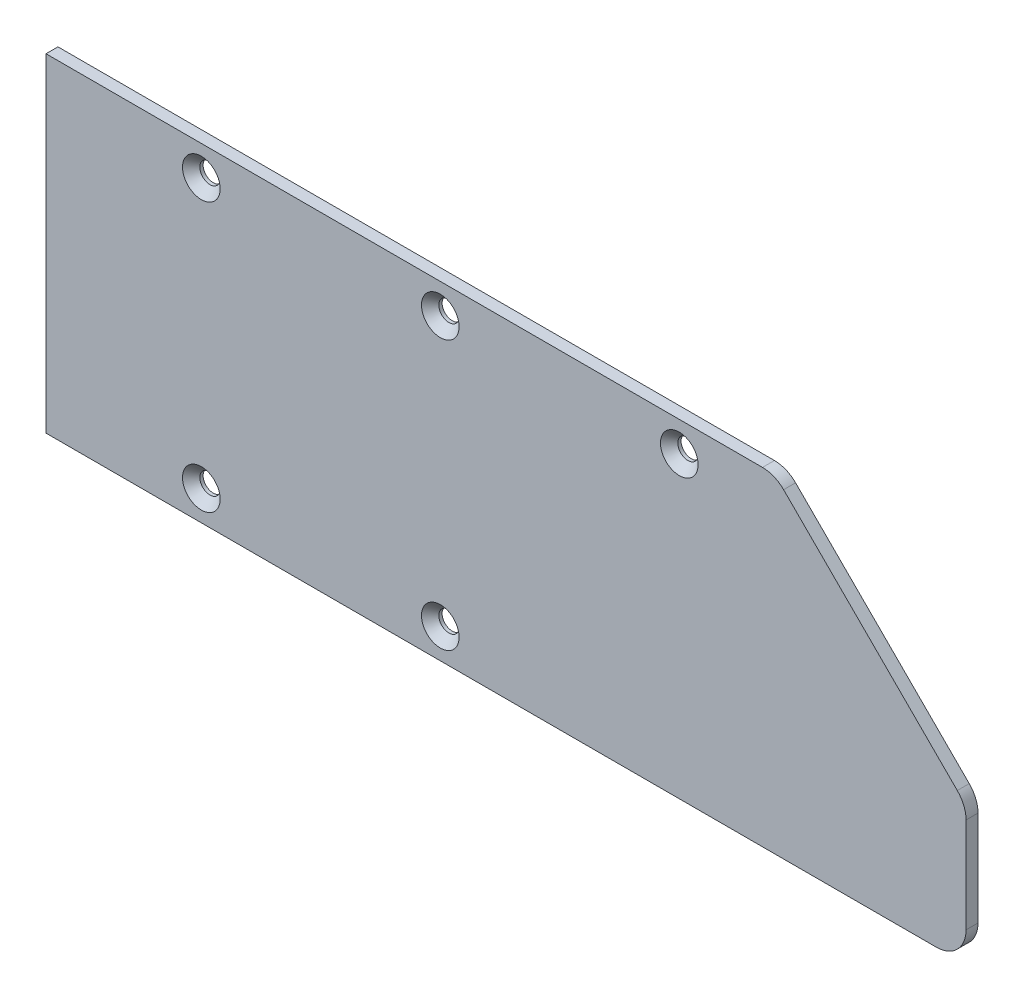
from build123d import *

# Parameters (mm, degrees)
ESQUISSE1_W                     = 154
ESQUISSE1_H                     = 55
EXTRUSION1_DEPTH                = 2
ENL_V_MAT_EXTRU_1_DEPTH         = 164.538986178
ENL_V_MAT_EXTRU_1_DEPTH_BACK    = 164.538986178
CONG_1_R                        = 5
R_P_TITION_LIN_AIRE1_COUNT      = 3
R_P_TITION_LIN_AIRE1_PITCH      = 40
R_P_TITION_LIN_AIRE1_COUNT_DIR2 = 2
R_P_TITION_LIN_AIRE1_PITCH_DIR2 = 45


with BuildPart() as part:
    # Esquisse1 → Extrusion1 (new body)
    with BuildSketch(Plane.XY):
        with Locations((77, 27.5)):
            Rectangle(ESQUISSE1_W, ESQUISSE1_H)
    extrude(amount=EXTRUSION1_DEPTH)

    # Esquisse2 → Enl_v. mat.-Extru.1 (cut, two sides: drawn at the far end of the back side and taken through both)
    with BuildSketch(Plane.XY.offset(2).offset(-ENL_V_MAT_EXTRU_1_DEPTH_BACK)):
        Polygon((-107.512071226, 284.512071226), (122, 55), (154, 23), (383.512071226, -206.512071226), (842.536213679, 252.512071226), (351.512071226, 743.536213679), align=None)
    extrude(amount=ENL_V_MAT_EXTRU_1_DEPTH + ENL_V_MAT_EXTRU_1_DEPTH_BACK, mode=Mode.SUBTRACT)

    # Cong_1
    cong_1_edges = [part.edges().sort_by_distance(p)[0] for p in [
        (154, 23, 1),
        (122, 55, 1),
        (154, 0, 1),
    ]]
    fillet(cong_1_edges, radius=CONG_1_R)

    # Esquisse3 → Fraisage pour vis _ t_te frais_e M31 (revolve, cut)
    with BuildSketch(Plane(origin=(26, 5, 2), x_dir=(0, -1, 0), z_dir=(1, 0, 0))):
        Polygon((0, 0), (0, 2), (1.7, 2), (1.7, 1.45), (3.15, 0), align=None)
    fraisage_pour_vis_t_te_frais_e_m31 = revolve(axis=Axis((26, 5, 8.35), (0, 0, -1)), mode=Mode.SUBTRACT)

    # R_p_tition lin_aire1: Fraisage pour vis _ t_te frais_e M31 3 × 2, 1 skipped
    with Locations(*[(i * R_P_TITION_LIN_AIRE1_PITCH, j * R_P_TITION_LIN_AIRE1_PITCH_DIR2, 0) for i in range(R_P_TITION_LIN_AIRE1_COUNT) for j in range(R_P_TITION_LIN_AIRE1_COUNT_DIR2) if (i, j) not in ((0, 0), (2, 0))]):
        add(fraisage_pour_vis_t_te_frais_e_m31, mode=Mode.SUBTRACT)


solid = part.part
